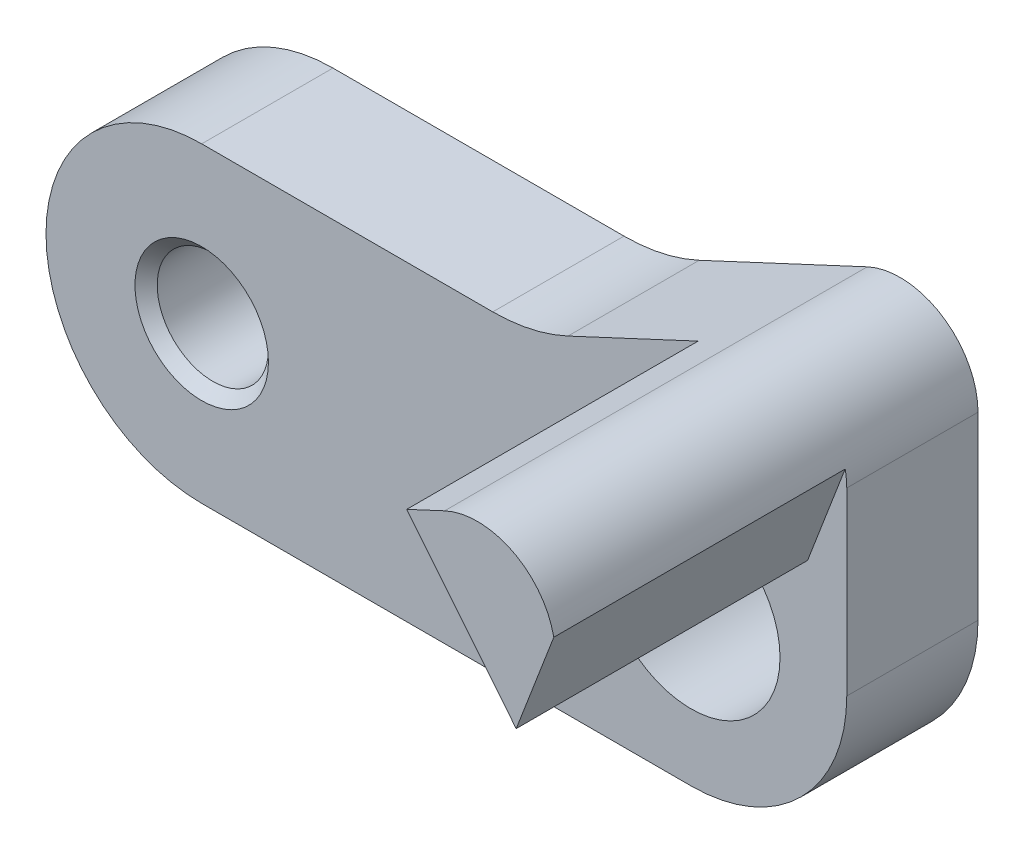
from build123d import *

# Parameters (mm, degrees)
EXTRUSION1_DEPTH        = 2.95
EXTRUSION2_DEPTH        = 6.55
ESQUISSE3_R             = 2
ENL_V_MAT_EXTRU_1_DEPTH = 6.55


with BuildPart() as part:
    # Esquisse1 → Extrusion1 (new body)
    with BuildSketch(Plane.XY):
        with BuildLine():
            Line((3.5, 0), (3.5, 4.05))
            ThreePointArc((3.5, 4.05), (2.690274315, 5.52593503), (1.010418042, 5.636038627))
            Line((1.010418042, 5.636038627), (-2.76663718, 3.874768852))
            ThreePointArc((-2.76663718, 3.874768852), (-3.591351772, 3.594815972), (-4.457110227, 3.5))
            Line((-4.457110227, 3.5), (-11, 3.5))
            ThreePointArc((-11, 3.5), (-14.5, 0), (-11, -3.5))
            Line((-11, -3.5), (0, -3.5))
            ThreePointArc((0, -3.5), (2.474873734, -2.474873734), (3.5, 0))
        make_face()
    extrude(amount=EXTRUSION1_DEPTH)

    # Esquisse2 → Extrusion2 (add)
    with BuildSketch(Plane.XY.offset(2.95)):
        with BuildLine():
            Line((0.1584529, 5.238760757), (2.619192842, 2.2))
            Line((2.619192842, 2.2), (3.464312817, 4.401612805))
            ThreePointArc((3.464312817, 4.401612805), (2.536432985, 5.613337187), (1.010418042, 5.636038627))
            Line((1.010418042, 5.636038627), (0.1584529, 5.238760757))
        make_face()
    extrude(amount=EXTRUSION2_DEPTH)

    # Esquisse3 → Enl_v. mat.-Extru.1 (cut)
    with BuildSketch(Plane.XY.offset(2.95)):
        Circle(ESQUISSE3_R)
    extrude(amount=-ENL_V_MAT_EXTRU_1_DEPTH, mode=Mode.SUBTRACT)

    # Esquisse9 → Trou taraud_ M3x0.54 (revolve, cut)
    with BuildSketch(Plane(origin=(-11, 0, 2.95), x_dir=(0, -1, 0), z_dir=(1, 0, 0))):
        Polygon((0, 0), (0, 2.95), (1.5, 2.95), (1.25, 2.7), (1.25, 0.25), (1.5, 0), align=None)
    revolve(axis=Axis((-11, 0, 9.3), (0, 0, -1)), mode=Mode.SUBTRACT)


solid = part.part
